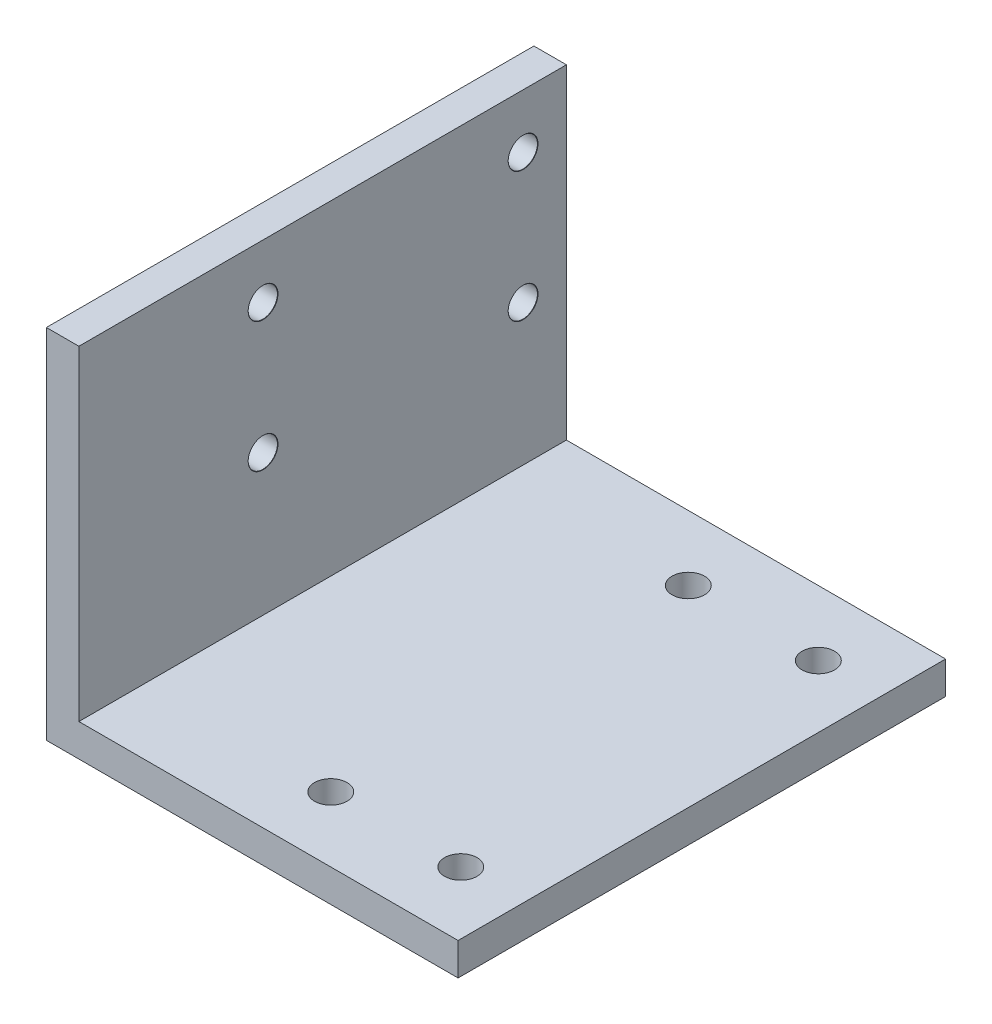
ISO-10303-21;
HEADER;
FILE_DESCRIPTION(('STEP AP214'),'2;1');
FILE_NAME('part.step','',(''),(''),'','','');
FILE_SCHEMA(('AUTOMOTIVE_DESIGN { 1 0 10303 214 1 1 1 1 }'));
ENDSEC;
DATA;
#1=APPLICATION_CONTEXT('core data for automotive mechanical design processes');
#2=APPLICATION_PROTOCOL_DEFINITION('international standard','automotive_design',2000,#1);
#3=PRODUCT_CONTEXT('',#1,'mechanical');
#4=PRODUCT('Part','Part','',(#3));
#5=PRODUCT_RELATED_PRODUCT_CATEGORY('part','',(#4));
#6=PRODUCT_DEFINITION_FORMATION('','',#4);
#7=PRODUCT_DEFINITION_CONTEXT('part definition',#1,'design');
#8=PRODUCT_DEFINITION('design','',#6,#7);
#9=PRODUCT_DEFINITION_SHAPE('','',#8);
#10=(LENGTH_UNIT() NAMED_UNIT(*) SI_UNIT(.MILLI.,.METRE.));
#11=(NAMED_UNIT(*) PLANE_ANGLE_UNIT() SI_UNIT($,.RADIAN.));
#12=(NAMED_UNIT(*) SI_UNIT($,.STERADIAN.) SOLID_ANGLE_UNIT());
#13=UNCERTAINTY_MEASURE_WITH_UNIT(LENGTH_MEASURE(1.E-05),#10,'distance_accuracy_value','');
#14=(GEOMETRIC_REPRESENTATION_CONTEXT(3) GLOBAL_UNCERTAINTY_ASSIGNED_CONTEXT((#13)) GLOBAL_UNIT_ASSIGNED_CONTEXT((#10,
#11,#12)) REPRESENTATION_CONTEXT('',''));
#15=CARTESIAN_POINT('',(0.,0.,0.));
#16=DIRECTION('',(0.,0.,1.));
#17=DIRECTION('',(1.,0.,0.));
#18=AXIS2_PLACEMENT_3D('',#15,#16,#17);
#19=CARTESIAN_POINT('',(0.,3.,0.));
#20=DIRECTION('',(0.,-1.,0.));
#21=DIRECTION('',(0.,0.,-1.));
#22=AXIS2_PLACEMENT_3D('',#19,#20,#21);
#23=PLANE('',#22);
#24=CARTESIAN_POINT('',(1.25000000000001,3.,16.5));
#25=DIRECTION('',(0.,1.,0.));
#26=DIRECTION('',(0.,0.,-1.));
#27=AXIS2_PLACEMENT_3D('',#24,#25,#26);
#28=CIRCLE('',#27,1.5);
#29=CARTESIAN_POINT('',(1.25000000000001,3.,15.));
#30=VERTEX_POINT('',#29);
#31=EDGE_CURVE('E167',#30,#30,#28,.T.);
#32=ORIENTED_EDGE('',*,*,#31,.F.);
#33=EDGE_LOOP('',(#32));
#34=FACE_BOUND('',#33,.T.);
#35=CARTESIAN_POINT('',(13.25,3.,16.5));
#36=DIRECTION('',(0.,1.,0.));
#37=DIRECTION('',(0.,0.,-1.));
#38=AXIS2_PLACEMENT_3D('',#35,#36,#37);
#39=CIRCLE('',#38,1.5);
#40=CARTESIAN_POINT('',(13.25,3.,15.));
#41=VERTEX_POINT('',#40);
#42=EDGE_CURVE('E173',#41,#41,#39,.T.);
#43=ORIENTED_EDGE('',*,*,#42,.F.);
#44=EDGE_LOOP('',(#43));
#45=FACE_BOUND('',#44,.T.);
#46=CARTESIAN_POINT('',(1.25000000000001,3.,-16.5));
#47=DIRECTION('',(0.,1.,0.));
#48=DIRECTION('',(0.,0.,1.));
#49=AXIS2_PLACEMENT_3D('',#46,#47,#48);
#50=CIRCLE('',#49,1.5);
#51=CARTESIAN_POINT('',(1.25000000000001,3.,-15.));
#52=VERTEX_POINT('',#51);
#53=EDGE_CURVE('E179',#52,#52,#50,.T.);
#54=ORIENTED_EDGE('',*,*,#53,.F.);
#55=EDGE_LOOP('',(#54));
#56=FACE_BOUND('',#55,.T.);
#57=CARTESIAN_POINT('',(13.25,3.,-16.5));
#58=DIRECTION('',(0.,1.,0.));
#59=DIRECTION('',(0.,0.,1.));
#60=AXIS2_PLACEMENT_3D('',#57,#58,#59);
#61=CIRCLE('',#60,1.5);
#62=CARTESIAN_POINT('',(13.25,3.,-15.));
#63=VERTEX_POINT('',#62);
#64=EDGE_CURVE('E103',#63,#63,#61,.T.);
#65=ORIENTED_EDGE('',*,*,#64,.F.);
#66=EDGE_LOOP('',(#65));
#67=FACE_BOUND('',#66,.T.);
#68=DIRECTION('',(0.,0.,-1.));
#69=VECTOR('',#68,1.);
#70=CARTESIAN_POINT('',(-16.,3.,22.5));
#71=LINE('',#70,#69);
#72=CARTESIAN_POINT('',(-16.,3.,22.5));
#73=VERTEX_POINT('',#72);
#74=CARTESIAN_POINT('',(-16.,3.,-22.5));
#75=VERTEX_POINT('',#74);
#76=EDGE_CURVE('E56',#73,#75,#71,.T.);
#77=ORIENTED_EDGE('',*,*,#76,.F.);
#78=DIRECTION('',(1.,0.,0.));
#79=VECTOR('',#78,1.);
#80=CARTESIAN_POINT('',(-19.,3.,22.5));
#81=LINE('',#80,#79);
#82=CARTESIAN_POINT('',(19.,3.,22.5));
#83=VERTEX_POINT('',#82);
#84=EDGE_CURVE('E61',#73,#83,#81,.T.);
#85=ORIENTED_EDGE('',*,*,#84,.T.);
#86=DIRECTION('',(0.,0.,-1.));
#87=VECTOR('',#86,1.);
#88=CARTESIAN_POINT('',(19.,3.,22.5));
#89=LINE('',#88,#87);
#90=CARTESIAN_POINT('',(19.,3.,-22.5));
#91=VERTEX_POINT('',#90);
#92=EDGE_CURVE('E92',#83,#91,#89,.T.);
#93=ORIENTED_EDGE('',*,*,#92,.T.);
#94=DIRECTION('',(-1.,0.,0.));
#95=VECTOR('',#94,1.);
#96=CARTESIAN_POINT('',(-19.,3.,-22.5));
#97=LINE('',#96,#95);
#98=EDGE_CURVE('E186',#91,#75,#97,.T.);
#99=ORIENTED_EDGE('',*,*,#98,.T.);
#100=EDGE_LOOP('',(#77,#85,#93,#99));
#101=FACE_BOUND('',#100,.T.);
#102=ADVANCED_FACE('F39',(#34,#45,#56,#67,#101),#23,.F.);
#103=CARTESIAN_POINT('',(0.,0.,0.));
#104=DIRECTION('',(0.,-1.,0.));
#105=DIRECTION('',(0.,0.,-1.));
#106=AXIS2_PLACEMENT_3D('',#103,#104,#105);
#107=PLANE('',#106);
#108=CARTESIAN_POINT('',(13.25,0.,16.5));
#109=DIRECTION('',(0.,1.,0.));
#110=DIRECTION('',(0.,0.,-1.));
#111=AXIS2_PLACEMENT_3D('',#108,#109,#110);
#112=CIRCLE('',#111,1.5);
#113=CARTESIAN_POINT('',(13.25,0.,15.));
#114=VERTEX_POINT('',#113);
#115=EDGE_CURVE('E170',#114,#114,#112,.T.);
#116=ORIENTED_EDGE('',*,*,#115,.T.);
#117=EDGE_LOOP('',(#116));
#118=FACE_BOUND('',#117,.T.);
#119=CARTESIAN_POINT('',(13.25,0.,-16.5));
#120=DIRECTION('',(0.,1.,0.));
#121=DIRECTION('',(0.,0.,1.));
#122=AXIS2_PLACEMENT_3D('',#119,#120,#121);
#123=CIRCLE('',#122,1.5);
#124=CARTESIAN_POINT('',(13.25,0.,-15.));
#125=VERTEX_POINT('',#124);
#126=EDGE_CURVE('E107',#125,#125,#123,.T.);
#127=ORIENTED_EDGE('',*,*,#126,.T.);
#128=EDGE_LOOP('',(#127));
#129=FACE_BOUND('',#128,.T.);
#130=DIRECTION('',(0.,0.,-1.));
#131=VECTOR('',#130,1.);
#132=CARTESIAN_POINT('',(19.,0.,22.5));
#133=LINE('',#132,#131);
#134=CARTESIAN_POINT('',(19.,0.,22.5));
#135=VERTEX_POINT('',#134);
#136=CARTESIAN_POINT('',(19.,0.,-22.5));
#137=VERTEX_POINT('',#136);
#138=EDGE_CURVE('E98',#135,#137,#133,.T.);
#139=ORIENTED_EDGE('',*,*,#138,.F.);
#140=DIRECTION('',(1.,0.,0.));
#141=VECTOR('',#140,1.);
#142=CARTESIAN_POINT('',(-19.,0.,22.5));
#143=LINE('',#142,#141);
#144=CARTESIAN_POINT('',(-19.,0.,22.5));
#145=VERTEX_POINT('',#144);
#146=EDGE_CURVE('E81',#145,#135,#143,.T.);
#147=ORIENTED_EDGE('',*,*,#146,.F.);
#148=DIRECTION('',(0.,0.,1.));
#149=VECTOR('',#148,1.);
#150=CARTESIAN_POINT('',(-19.,0.,22.5));
#151=LINE('',#150,#149);
#152=CARTESIAN_POINT('',(-19.,0.,-22.5));
#153=VERTEX_POINT('',#152);
#154=EDGE_CURVE('E93',#153,#145,#151,.T.);
#155=ORIENTED_EDGE('',*,*,#154,.F.);
#156=DIRECTION('',(-1.,0.,0.));
#157=VECTOR('',#156,1.);
#158=CARTESIAN_POINT('',(-19.,0.,-22.5));
#159=LINE('',#158,#157);
#160=EDGE_CURVE('E102',#137,#153,#159,.T.);
#161=ORIENTED_EDGE('',*,*,#160,.F.);
#162=EDGE_LOOP('',(#139,#147,#155,#161));
#163=FACE_BOUND('',#162,.T.);
#164=CARTESIAN_POINT('',(1.25000000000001,0.,-16.5));
#165=DIRECTION('',(0.,1.,0.));
#166=DIRECTION('',(0.,0.,1.));
#167=AXIS2_PLACEMENT_3D('',#164,#165,#166);
#168=CIRCLE('',#167,1.5);
#169=CARTESIAN_POINT('',(1.25000000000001,0.,-15.));
#170=VERTEX_POINT('',#169);
#171=EDGE_CURVE('E176',#170,#170,#168,.T.);
#172=ORIENTED_EDGE('',*,*,#171,.T.);
#173=EDGE_LOOP('',(#172));
#174=FACE_BOUND('',#173,.T.);
#175=CARTESIAN_POINT('',(1.25000000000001,0.,16.5));
#176=DIRECTION('',(0.,1.,0.));
#177=DIRECTION('',(0.,0.,-1.));
#178=AXIS2_PLACEMENT_3D('',#175,#176,#177);
#179=CIRCLE('',#178,1.5);
#180=CARTESIAN_POINT('',(1.25000000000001,0.,15.));
#181=VERTEX_POINT('',#180);
#182=EDGE_CURVE('E166',#181,#181,#179,.T.);
#183=ORIENTED_EDGE('',*,*,#182,.T.);
#184=EDGE_LOOP('',(#183));
#185=FACE_BOUND('',#184,.T.);
#186=ADVANCED_FACE('F100',(#118,#129,#163,#174,#185),#107,.T.);
#187=CARTESIAN_POINT('',(19.,3.,22.5));
#188=DIRECTION('',(-1.,0.,0.));
#189=DIRECTION('',(0.,0.,1.));
#190=AXIS2_PLACEMENT_3D('',#187,#188,#189);
#191=PLANE('',#190);
#192=ORIENTED_EDGE('',*,*,#138,.T.);
#193=DIRECTION('',(0.,-1.,0.));
#194=VECTOR('',#193,1.);
#195=CARTESIAN_POINT('',(19.,3.,-22.5));
#196=LINE('',#195,#194);
#197=EDGE_CURVE('E11',#91,#137,#196,.T.);
#198=ORIENTED_EDGE('',*,*,#197,.F.);
#199=ORIENTED_EDGE('',*,*,#92,.F.);
#200=DIRECTION('',(0.,-1.,0.));
#201=VECTOR('',#200,1.);
#202=CARTESIAN_POINT('',(19.,3.,22.5));
#203=LINE('',#202,#201);
#204=EDGE_CURVE('E84',#83,#135,#203,.T.);
#205=ORIENTED_EDGE('',*,*,#204,.T.);
#206=EDGE_LOOP('',(#192,#198,#199,#205));
#207=FACE_BOUND('',#206,.T.);
#208=ADVANCED_FACE('F41',(#207),#191,.F.);
#209=CARTESIAN_POINT('',(-19.,3.,-22.5));
#210=DIRECTION('',(0.,0.,1.));
#211=DIRECTION('',(1.,0.,0.));
#212=AXIS2_PLACEMENT_3D('',#209,#210,#211);
#213=PLANE('',#212);
#214=ORIENTED_EDGE('',*,*,#160,.T.);
#215=DIRECTION('',(0.,-1.,0.));
#216=VECTOR('',#215,1.);
#217=CARTESIAN_POINT('',(-19.,3.,-22.5));
#218=LINE('',#217,#216);
#219=CARTESIAN_POINT('',(-19.,33.,-22.5));
#220=VERTEX_POINT('',#219);
#221=EDGE_CURVE('E48',#220,#153,#218,.T.);
#222=ORIENTED_EDGE('',*,*,#221,.F.);
#223=DIRECTION('',(-1.,0.,0.));
#224=VECTOR('',#223,1.);
#225=CARTESIAN_POINT('',(-16.,33.,-22.5));
#226=LINE('',#225,#224);
#227=CARTESIAN_POINT('',(-16.,33.,-22.5));
#228=VERTEX_POINT('',#227);
#229=EDGE_CURVE('E150',#228,#220,#226,.T.);
#230=ORIENTED_EDGE('',*,*,#229,.F.);
#231=DIRECTION('',(0.,-1.,0.));
#232=VECTOR('',#231,1.);
#233=CARTESIAN_POINT('',(-16.,33.,-22.5));
#234=LINE('',#233,#232);
#235=EDGE_CURVE('E163',#228,#75,#234,.T.);
#236=ORIENTED_EDGE('',*,*,#235,.T.);
#237=ORIENTED_EDGE('',*,*,#98,.F.);
#238=ORIENTED_EDGE('',*,*,#197,.T.);
#239=EDGE_LOOP('',(#214,#222,#230,#236,#237,#238));
#240=FACE_BOUND('',#239,.T.);
#241=ADVANCED_FACE('F192',(#240),#213,.F.);
#242=CARTESIAN_POINT('',(-19.,3.,22.5));
#243=DIRECTION('',(1.,0.,0.));
#244=DIRECTION('',(0.,0.,-1.));
#245=AXIS2_PLACEMENT_3D('',#242,#243,#244);
#246=PLANE('',#245);
#247=CARTESIAN_POINT('',(-19.,28.,-18.5000000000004));
#248=DIRECTION('',(1.,0.,0.));
#249=DIRECTION('',(0.,0.,-1.));
#250=AXIS2_PLACEMENT_3D('',#247,#248,#249);
#251=CIRCLE('',#250,1.35);
#252=CARTESIAN_POINT('',(-19.,28.,-19.8500000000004));
#253=VERTEX_POINT('',#252);
#254=EDGE_CURVE('E43',#253,#253,#251,.T.);
#255=ORIENTED_EDGE('',*,*,#254,.T.);
#256=EDGE_LOOP('',(#255));
#257=FACE_BOUND('',#256,.T.);
#258=CARTESIAN_POINT('',(-19.,16.,-18.5000000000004));
#259=DIRECTION('',(1.,0.,0.));
#260=DIRECTION('',(0.,0.,-1.));
#261=AXIS2_PLACEMENT_3D('',#258,#259,#260);
#262=CIRCLE('',#261,1.35);
#263=CARTESIAN_POINT('',(-19.,16.,-19.8500000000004));
#264=VERTEX_POINT('',#263);
#265=EDGE_CURVE('E124',#264,#264,#262,.T.);
#266=ORIENTED_EDGE('',*,*,#265,.T.);
#267=EDGE_LOOP('',(#266));
#268=FACE_BOUND('',#267,.T.);
#269=CARTESIAN_POINT('',(-19.,28.,5.49999999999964));
#270=DIRECTION('',(1.,0.,0.));
#271=DIRECTION('',(0.,0.,-1.));
#272=AXIS2_PLACEMENT_3D('',#269,#270,#271);
#273=CIRCLE('',#272,1.35);
#274=CARTESIAN_POINT('',(-19.,28.,4.14999999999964));
#275=VERTEX_POINT('',#274);
#276=EDGE_CURVE('E120',#275,#275,#273,.T.);
#277=ORIENTED_EDGE('',*,*,#276,.T.);
#278=EDGE_LOOP('',(#277));
#279=FACE_BOUND('',#278,.T.);
#280=CARTESIAN_POINT('',(-19.,16.,5.49999999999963));
#281=DIRECTION('',(1.,0.,0.));
#282=DIRECTION('',(0.,0.,-1.));
#283=AXIS2_PLACEMENT_3D('',#280,#281,#282);
#284=CIRCLE('',#283,1.35);
#285=CARTESIAN_POINT('',(-19.,16.,4.14999999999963));
#286=VERTEX_POINT('',#285);
#287=EDGE_CURVE('E116',#286,#286,#284,.T.);
#288=ORIENTED_EDGE('',*,*,#287,.T.);
#289=EDGE_LOOP('',(#288));
#290=FACE_BOUND('',#289,.T.);
#291=ORIENTED_EDGE('',*,*,#154,.T.);
#292=DIRECTION('',(0.,-1.,0.));
#293=VECTOR('',#292,1.);
#294=CARTESIAN_POINT('',(-19.,3.,22.5));
#295=LINE('',#294,#293);
#296=CARTESIAN_POINT('',(-19.,33.,22.5));
#297=VERTEX_POINT('',#296);
#298=EDGE_CURVE('E88',#297,#145,#295,.T.);
#299=ORIENTED_EDGE('',*,*,#298,.F.);
#300=DIRECTION('',(0.,0.,1.));
#301=VECTOR('',#300,1.);
#302=CARTESIAN_POINT('',(-19.,33.,22.5));
#303=LINE('',#302,#301);
#304=EDGE_CURVE('E153',#220,#297,#303,.T.);
#305=ORIENTED_EDGE('',*,*,#304,.F.);
#306=ORIENTED_EDGE('',*,*,#221,.T.);
#307=EDGE_LOOP('',(#291,#299,#305,#306));
#308=FACE_BOUND('',#307,.T.);
#309=ADVANCED_FACE('F208',(#257,#268,#279,#290,#308),#246,.F.);
#310=CARTESIAN_POINT('',(-19.,3.,22.5));
#311=DIRECTION('',(0.,0.,-1.));
#312=DIRECTION('',(-1.,0.,0.));
#313=AXIS2_PLACEMENT_3D('',#310,#311,#312);
#314=PLANE('',#313);
#315=ORIENTED_EDGE('',*,*,#146,.T.);
#316=ORIENTED_EDGE('',*,*,#204,.F.);
#317=ORIENTED_EDGE('',*,*,#84,.F.);
#318=DIRECTION('',(0.,-1.,0.));
#319=VECTOR('',#318,1.);
#320=CARTESIAN_POINT('',(-16.,33.,22.5));
#321=LINE('',#320,#319);
#322=CARTESIAN_POINT('',(-16.,33.,22.5));
#323=VERTEX_POINT('',#322);
#324=EDGE_CURVE('E159',#323,#73,#321,.T.);
#325=ORIENTED_EDGE('',*,*,#324,.F.);
#326=DIRECTION('',(1.,0.,0.));
#327=VECTOR('',#326,1.);
#328=CARTESIAN_POINT('',(-16.,33.,22.5));
#329=LINE('',#328,#327);
#330=EDGE_CURVE('E156',#297,#323,#329,.T.);
#331=ORIENTED_EDGE('',*,*,#330,.F.);
#332=ORIENTED_EDGE('',*,*,#298,.T.);
#333=EDGE_LOOP('',(#315,#316,#317,#325,#331,#332));
#334=FACE_BOUND('',#333,.T.);
#335=ADVANCED_FACE('F83',(#334),#314,.F.);
#336=CARTESIAN_POINT('',(13.25,3.,-16.5));
#337=DIRECTION('',(0.,-1.,0.));
#338=DIRECTION('',(0.,0.,-1.));
#339=AXIS2_PLACEMENT_3D('',#336,#337,#338);
#340=CYLINDRICAL_SURFACE('',#339,1.5);
#341=ORIENTED_EDGE('',*,*,#64,.T.);
#342=EDGE_LOOP('',(#341));
#343=FACE_BOUND('',#342,.T.);
#344=ORIENTED_EDGE('',*,*,#126,.F.);
#345=EDGE_LOOP('',(#344));
#346=FACE_BOUND('',#345,.T.);
#347=ADVANCED_FACE('F216',(#343,#346),#340,.F.);
#348=CARTESIAN_POINT('',(1.25000000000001,3.,-16.5));
#349=DIRECTION('',(0.,-1.,0.));
#350=DIRECTION('',(0.,0.,-1.));
#351=AXIS2_PLACEMENT_3D('',#348,#349,#350);
#352=CYLINDRICAL_SURFACE('',#351,1.5);
#353=ORIENTED_EDGE('',*,*,#53,.T.);
#354=EDGE_LOOP('',(#353));
#355=FACE_BOUND('',#354,.T.);
#356=ORIENTED_EDGE('',*,*,#171,.F.);
#357=EDGE_LOOP('',(#356));
#358=FACE_BOUND('',#357,.T.);
#359=ADVANCED_FACE('F232',(#355,#358),#352,.F.);
#360=CARTESIAN_POINT('',(13.25,3.,16.5));
#361=DIRECTION('',(0.,-1.,0.));
#362=DIRECTION('',(0.,0.,-1.));
#363=AXIS2_PLACEMENT_3D('',#360,#361,#362);
#364=CYLINDRICAL_SURFACE('',#363,1.5);
#365=ORIENTED_EDGE('',*,*,#42,.T.);
#366=EDGE_LOOP('',(#365));
#367=FACE_BOUND('',#366,.T.);
#368=ORIENTED_EDGE('',*,*,#115,.F.);
#369=EDGE_LOOP('',(#368));
#370=FACE_BOUND('',#369,.T.);
#371=ADVANCED_FACE('F236',(#367,#370),#364,.F.);
#372=CARTESIAN_POINT('',(1.25000000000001,3.,16.5));
#373=DIRECTION('',(0.,-1.,0.));
#374=DIRECTION('',(0.,0.,-1.));
#375=AXIS2_PLACEMENT_3D('',#372,#373,#374);
#376=CYLINDRICAL_SURFACE('',#375,1.5);
#377=ORIENTED_EDGE('',*,*,#31,.T.);
#378=EDGE_LOOP('',(#377));
#379=FACE_BOUND('',#378,.T.);
#380=ORIENTED_EDGE('',*,*,#182,.F.);
#381=EDGE_LOOP('',(#380));
#382=FACE_BOUND('',#381,.T.);
#383=ADVANCED_FACE('F240',(#379,#382),#376,.F.);
#384=CARTESIAN_POINT('',(-16.,33.,22.5));
#385=DIRECTION('',(-1.,0.,0.));
#386=DIRECTION('',(0.,0.,1.));
#387=AXIS2_PLACEMENT_3D('',#384,#385,#386);
#388=PLANE('',#387);
#389=CARTESIAN_POINT('',(-16.,28.,-18.5000000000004));
#390=DIRECTION('',(1.,0.,0.));
#391=DIRECTION('',(0.,0.,-1.));
#392=AXIS2_PLACEMENT_3D('',#389,#390,#391);
#393=CIRCLE('',#392,1.375);
#394=CARTESIAN_POINT('',(-16.,28.,-19.8750000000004));
#395=VERTEX_POINT('',#394);
#396=EDGE_CURVE('E288',#395,#395,#393,.T.);
#397=ORIENTED_EDGE('',*,*,#396,.F.);
#398=EDGE_LOOP('',(#397));
#399=FACE_BOUND('',#398,.T.);
#400=CARTESIAN_POINT('',(-16.,16.,-18.5000000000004));
#401=DIRECTION('',(1.,0.,0.));
#402=DIRECTION('',(0.,0.,-1.));
#403=AXIS2_PLACEMENT_3D('',#400,#401,#402);
#404=CIRCLE('',#403,1.375);
#405=CARTESIAN_POINT('',(-16.,16.,-19.8750000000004));
#406=VERTEX_POINT('',#405);
#407=EDGE_CURVE('E133',#406,#406,#404,.T.);
#408=ORIENTED_EDGE('',*,*,#407,.F.);
#409=EDGE_LOOP('',(#408));
#410=FACE_BOUND('',#409,.T.);
#411=CARTESIAN_POINT('',(-16.,28.,5.49999999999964));
#412=DIRECTION('',(1.,0.,0.));
#413=DIRECTION('',(0.,0.,-1.));
#414=AXIS2_PLACEMENT_3D('',#411,#412,#413);
#415=CIRCLE('',#414,1.375);
#416=CARTESIAN_POINT('',(-16.,28.,4.12499999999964));
#417=VERTEX_POINT('',#416);
#418=EDGE_CURVE('E126',#417,#417,#415,.T.);
#419=ORIENTED_EDGE('',*,*,#418,.F.);
#420=EDGE_LOOP('',(#419));
#421=FACE_BOUND('',#420,.T.);
#422=CARTESIAN_POINT('',(-16.,16.,5.49999999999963));
#423=DIRECTION('',(1.,0.,0.));
#424=DIRECTION('',(0.,0.,-1.));
#425=AXIS2_PLACEMENT_3D('',#422,#423,#424);
#426=CIRCLE('',#425,1.375);
#427=CARTESIAN_POINT('',(-16.,16.,4.12499999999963));
#428=VERTEX_POINT('',#427);
#429=EDGE_CURVE('E122',#428,#428,#426,.T.);
#430=ORIENTED_EDGE('',*,*,#429,.F.);
#431=EDGE_LOOP('',(#430));
#432=FACE_BOUND('',#431,.T.);
#433=ORIENTED_EDGE('',*,*,#76,.T.);
#434=ORIENTED_EDGE('',*,*,#235,.F.);
#435=DIRECTION('',(0.,0.,-1.));
#436=VECTOR('',#435,1.);
#437=CARTESIAN_POINT('',(-16.,33.,22.5));
#438=LINE('',#437,#436);
#439=EDGE_CURVE('E147',#323,#228,#438,.T.);
#440=ORIENTED_EDGE('',*,*,#439,.F.);
#441=ORIENTED_EDGE('',*,*,#324,.T.);
#442=EDGE_LOOP('',(#433,#434,#440,#441));
#443=FACE_BOUND('',#442,.T.);
#444=ADVANCED_FACE('F196',(#399,#410,#421,#432,#443),#388,.F.);
#445=CARTESIAN_POINT('',(0.,33.,0.));
#446=DIRECTION('',(0.,1.,0.));
#447=DIRECTION('',(0.,0.,1.));
#448=AXIS2_PLACEMENT_3D('',#445,#446,#447);
#449=PLANE('',#448);
#450=ORIENTED_EDGE('',*,*,#439,.T.);
#451=ORIENTED_EDGE('',*,*,#229,.T.);
#452=ORIENTED_EDGE('',*,*,#304,.T.);
#453=ORIENTED_EDGE('',*,*,#330,.T.);
#454=EDGE_LOOP('',(#450,#451,#452,#453));
#455=FACE_BOUND('',#454,.T.);
#456=ADVANCED_FACE('F207',(#455),#449,.T.);
#457=CARTESIAN_POINT('',(-16.,16.,5.49999999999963));
#458=DIRECTION('',(1.,0.,0.));
#459=DIRECTION('',(0.,0.,-1.));
#460=AXIS2_PLACEMENT_3D('',#457,#458,#459);
#461=CYLINDRICAL_SURFACE('',#460,1.35);
#462=CARTESIAN_POINT('',(-16.025,16.,5.49999999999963));
#463=DIRECTION('',(1.,0.,0.));
#464=DIRECTION('',(0.,0.,-1.));
#465=AXIS2_PLACEMENT_3D('',#462,#463,#464);
#466=CIRCLE('',#465,1.35);
#467=CARTESIAN_POINT('',(-16.025,16.,4.14999999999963));
#468=VERTEX_POINT('',#467);
#469=EDGE_CURVE('E119',#468,#468,#466,.T.);
#470=ORIENTED_EDGE('',*,*,#469,.T.);
#471=EDGE_LOOP('',(#470));
#472=FACE_BOUND('',#471,.T.);
#473=ORIENTED_EDGE('',*,*,#287,.F.);
#474=EDGE_LOOP('',(#473));
#475=FACE_BOUND('',#474,.T.);
#476=ADVANCED_FACE('F250',(#472,#475),#461,.F.);
#477=CARTESIAN_POINT('',(-16.,16.,5.49999999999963));
#478=DIRECTION('',(1.,0.,0.));
#479=DIRECTION('',(0.,0.,-1.));
#480=AXIS2_PLACEMENT_3D('',#477,#478,#479);
#481=CONICAL_SURFACE('',#480,1.375,0.785398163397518);
#482=ORIENTED_EDGE('',*,*,#469,.F.);
#483=EDGE_LOOP('',(#482));
#484=FACE_BOUND('',#483,.T.);
#485=ORIENTED_EDGE('',*,*,#429,.T.);
#486=EDGE_LOOP('',(#485));
#487=FACE_BOUND('',#486,.T.);
#488=ADVANCED_FACE('F253',(#484,#487),#481,.F.);
#489=CARTESIAN_POINT('',(-16.,28.,5.49999999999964));
#490=DIRECTION('',(1.,0.,0.));
#491=DIRECTION('',(0.,0.,-1.));
#492=AXIS2_PLACEMENT_3D('',#489,#490,#491);
#493=CYLINDRICAL_SURFACE('',#492,1.35);
#494=CARTESIAN_POINT('',(-16.025,28.,5.49999999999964));
#495=DIRECTION('',(1.,0.,0.));
#496=DIRECTION('',(0.,0.,-1.));
#497=AXIS2_PLACEMENT_3D('',#494,#495,#496);
#498=CIRCLE('',#497,1.35);
#499=CARTESIAN_POINT('',(-16.025,28.,4.14999999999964));
#500=VERTEX_POINT('',#499);
#501=EDGE_CURVE('E123',#500,#500,#498,.T.);
#502=ORIENTED_EDGE('',*,*,#501,.T.);
#503=EDGE_LOOP('',(#502));
#504=FACE_BOUND('',#503,.T.);
#505=ORIENTED_EDGE('',*,*,#276,.F.);
#506=EDGE_LOOP('',(#505));
#507=FACE_BOUND('',#506,.T.);
#508=ADVANCED_FACE('F257',(#504,#507),#493,.F.);
#509=CARTESIAN_POINT('',(-16.,28.,5.49999999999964));
#510=DIRECTION('',(1.,0.,0.));
#511=DIRECTION('',(0.,0.,-1.));
#512=AXIS2_PLACEMENT_3D('',#509,#510,#511);
#513=CONICAL_SURFACE('',#512,1.375,0.785398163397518);
#514=ORIENTED_EDGE('',*,*,#501,.F.);
#515=EDGE_LOOP('',(#514));
#516=FACE_BOUND('',#515,.T.);
#517=ORIENTED_EDGE('',*,*,#418,.T.);
#518=EDGE_LOOP('',(#517));
#519=FACE_BOUND('',#518,.T.);
#520=ADVANCED_FACE('F261',(#516,#519),#513,.F.);
#521=CARTESIAN_POINT('',(-16.,16.,-18.5000000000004));
#522=DIRECTION('',(1.,0.,0.));
#523=DIRECTION('',(0.,0.,-1.));
#524=AXIS2_PLACEMENT_3D('',#521,#522,#523);
#525=CYLINDRICAL_SURFACE('',#524,1.35);
#526=CARTESIAN_POINT('',(-16.025,16.,-18.5000000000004));
#527=DIRECTION('',(1.,0.,0.));
#528=DIRECTION('',(0.,0.,-1.));
#529=AXIS2_PLACEMENT_3D('',#526,#527,#528);
#530=CIRCLE('',#529,1.35);
#531=CARTESIAN_POINT('',(-16.025,16.,-19.8500000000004));
#532=VERTEX_POINT('',#531);
#533=EDGE_CURVE('E127',#532,#532,#530,.T.);
#534=ORIENTED_EDGE('',*,*,#533,.T.);
#535=EDGE_LOOP('',(#534));
#536=FACE_BOUND('',#535,.T.);
#537=ORIENTED_EDGE('',*,*,#265,.F.);
#538=EDGE_LOOP('',(#537));
#539=FACE_BOUND('',#538,.T.);
#540=ADVANCED_FACE('F265',(#536,#539),#525,.F.);
#541=CARTESIAN_POINT('',(-16.,16.,-18.5000000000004));
#542=DIRECTION('',(1.,0.,0.));
#543=DIRECTION('',(0.,0.,-1.));
#544=AXIS2_PLACEMENT_3D('',#541,#542,#543);
#545=CONICAL_SURFACE('',#544,1.375,0.785398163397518);
#546=ORIENTED_EDGE('',*,*,#533,.F.);
#547=EDGE_LOOP('',(#546));
#548=FACE_BOUND('',#547,.T.);
#549=ORIENTED_EDGE('',*,*,#407,.T.);
#550=EDGE_LOOP('',(#549));
#551=FACE_BOUND('',#550,.T.);
#552=ADVANCED_FACE('F269',(#548,#551),#545,.F.);
#553=CARTESIAN_POINT('',(-16.,28.,-18.5000000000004));
#554=DIRECTION('',(1.,0.,0.));
#555=DIRECTION('',(0.,0.,-1.));
#556=AXIS2_PLACEMENT_3D('',#553,#554,#555);
#557=CYLINDRICAL_SURFACE('',#556,1.35);
#558=CARTESIAN_POINT('',(-16.025,28.,-18.5000000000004));
#559=DIRECTION('',(1.,0.,0.));
#560=DIRECTION('',(0.,0.,-1.));
#561=AXIS2_PLACEMENT_3D('',#558,#559,#560);
#562=CIRCLE('',#561,1.35);
#563=CARTESIAN_POINT('',(-16.025,28.,-19.8500000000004));
#564=VERTEX_POINT('',#563);
#565=EDGE_CURVE('E285',#564,#564,#562,.T.);
#566=ORIENTED_EDGE('',*,*,#565,.T.);
#567=EDGE_LOOP('',(#566));
#568=FACE_BOUND('',#567,.T.);
#569=ORIENTED_EDGE('',*,*,#254,.F.);
#570=EDGE_LOOP('',(#569));
#571=FACE_BOUND('',#570,.T.);
#572=ADVANCED_FACE('F272',(#568,#571),#557,.F.);
#573=CARTESIAN_POINT('',(-16.,28.,-18.5000000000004));
#574=DIRECTION('',(1.,0.,0.));
#575=DIRECTION('',(0.,0.,-1.));
#576=AXIS2_PLACEMENT_3D('',#573,#574,#575);
#577=CONICAL_SURFACE('',#576,1.375,0.785398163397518);
#578=ORIENTED_EDGE('',*,*,#565,.F.);
#579=EDGE_LOOP('',(#578));
#580=FACE_BOUND('',#579,.T.);
#581=ORIENTED_EDGE('',*,*,#396,.T.);
#582=EDGE_LOOP('',(#581));
#583=FACE_BOUND('',#582,.T.);
#584=ADVANCED_FACE('F276',(#580,#583),#577,.F.);
#585=CLOSED_SHELL('',(#102,#186,#208,#241,#309,#335,#347,#359,#371,#383,#444,#456,#476,#488,
#508,#520,#540,#552,#572,#584));
#586=MANIFOLD_SOLID_BREP('B2',#585);
#587=ADVANCED_BREP_SHAPE_REPRESENTATION('',(#18,#586),#14);
#588=SHAPE_DEFINITION_REPRESENTATION(#9,#587);
ENDSEC;
END-ISO-10303-21;
